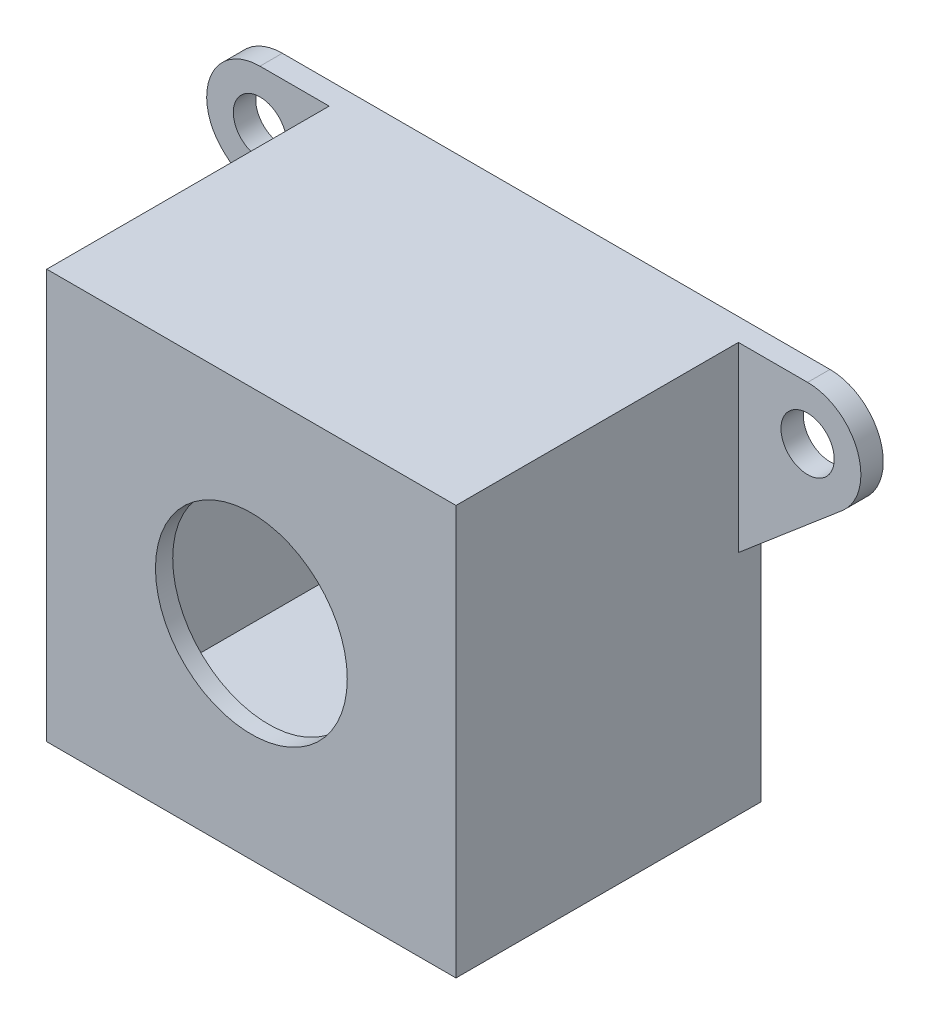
ISO-10303-21;
HEADER;
FILE_DESCRIPTION(('STEP AP214'),'2;1');
FILE_NAME('part.step','',(''),(''),'','','');
FILE_SCHEMA(('AUTOMOTIVE_DESIGN { 1 0 10303 214 1 1 1 1 }'));
ENDSEC;
DATA;
#1=APPLICATION_CONTEXT('core data for automotive mechanical design processes');
#2=APPLICATION_PROTOCOL_DEFINITION('international standard','automotive_design',2000,#1);
#3=PRODUCT_CONTEXT('',#1,'mechanical');
#4=PRODUCT('Part','Part','',(#3));
#5=PRODUCT_RELATED_PRODUCT_CATEGORY('part','',(#4));
#6=PRODUCT_DEFINITION_FORMATION('','',#4);
#7=PRODUCT_DEFINITION_CONTEXT('part definition',#1,'design');
#8=PRODUCT_DEFINITION('design','',#6,#7);
#9=PRODUCT_DEFINITION_SHAPE('','',#8);
#10=(LENGTH_UNIT() NAMED_UNIT(*) SI_UNIT(.MILLI.,.METRE.));
#11=(NAMED_UNIT(*) PLANE_ANGLE_UNIT() SI_UNIT($,.RADIAN.));
#12=(NAMED_UNIT(*) SI_UNIT($,.STERADIAN.) SOLID_ANGLE_UNIT());
#13=UNCERTAINTY_MEASURE_WITH_UNIT(LENGTH_MEASURE(1.E-05),#10,'distance_accuracy_value','');
#14=(GEOMETRIC_REPRESENTATION_CONTEXT(3) GLOBAL_UNCERTAINTY_ASSIGNED_CONTEXT((#13)) GLOBAL_UNIT_ASSIGNED_CONTEXT((#10,
#11,#12)) REPRESENTATION_CONTEXT('',''));
#15=CARTESIAN_POINT('',(0.,0.,0.));
#16=DIRECTION('',(0.,0.,1.));
#17=DIRECTION('',(1.,0.,0.));
#18=AXIS2_PLACEMENT_3D('',#15,#16,#17);
#19=CARTESIAN_POINT('',(0.,0.,2.667));
#20=DIRECTION('',(0.,0.,1.));
#21=DIRECTION('',(1.,0.,0.));
#22=AXIS2_PLACEMENT_3D('',#19,#20,#21);
#23=PLANE('',#22);
#24=DIRECTION('',(0.,1.,0.));
#25=VECTOR('',#24,1.);
#26=CARTESIAN_POINT('',(25.1785734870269,-30.3738616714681,2.667));
#27=LINE('',#26,#25);
#28=CARTESIAN_POINT('',(25.1785734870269,-3.29262330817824,2.667));
#29=VERTEX_POINT('',#28);
#30=CARTESIAN_POINT('',(25.1785734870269,18.3941383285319,2.667));
#31=VERTEX_POINT('',#30);
#32=EDGE_CURVE('E11',#29,#31,#27,.T.);
#33=ORIENTED_EDGE('',*,*,#32,.F.);
#34=DIRECTION('',(0.762118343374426,0.647437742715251,0.));
#35=VECTOR('',#34,1.);
#36=CARTESIAN_POINT('',(12.1789043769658,-14.3361528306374,2.667));
#37=LINE('',#36,#35);
#38=CARTESIAN_POINT('',(37.5352714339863,7.20468684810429,2.667));
#39=VERTEX_POINT('',#38);
#40=EDGE_CURVE('E199',#29,#39,#37,.T.);
#41=ORIENTED_EDGE('',*,*,#40,.T.);
#42=CARTESIAN_POINT('',(33.4240417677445,12.0441383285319,2.667));
#43=DIRECTION('',(0.,0.,1.));
#44=DIRECTION('',(1.,0.,0.));
#45=AXIS2_PLACEMENT_3D('',#42,#43,#44);
#46=CIRCLE('',#45,6.35);
#47=CARTESIAN_POINT('',(33.4240417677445,18.3941383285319,2.667));
#48=VERTEX_POINT('',#47);
#49=EDGE_CURVE('E218',#39,#48,#46,.T.);
#50=ORIENTED_EDGE('',*,*,#49,.T.);
#51=DIRECTION('',(1.,0.,0.));
#52=VECTOR('',#51,1.);
#53=CARTESIAN_POINT('',(0.,18.3941383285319,2.667));
#54=LINE('',#53,#52);
#55=EDGE_CURVE('E50',#31,#48,#54,.T.);
#56=ORIENTED_EDGE('',*,*,#55,.F.);
#57=EDGE_LOOP('',(#33,#41,#50,#56));
#58=FACE_BOUND('',#57,.T.);
#59=CARTESIAN_POINT('',(33.4240417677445,12.0441383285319,2.667));
#60=DIRECTION('',(0.,0.,1.));
#61=DIRECTION('',(1.,0.,0.));
#62=AXIS2_PLACEMENT_3D('',#59,#60,#61);
#63=CIRCLE('',#62,3.1749999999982);
#64=CARTESIAN_POINT('',(36.5990417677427,12.0441383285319,2.667));
#65=VERTEX_POINT('',#64);
#66=EDGE_CURVE('E228',#65,#65,#63,.F.);
#67=ORIENTED_EDGE('',*,*,#66,.T.);
#68=EDGE_LOOP('',(#67));
#69=FACE_BOUND('',#68,.T.);
#70=ADVANCED_FACE('F33',(#58,#69),#23,.T.);
#71=CARTESIAN_POINT('',(-31.8348947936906,12.0441383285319,2.667));
#72=DIRECTION('',(0.,0.,-1.));
#73=DIRECTION('',(-1.,0.,0.));
#74=AXIS2_PLACEMENT_3D('',#71,#72,#73);
#75=CYLINDRICAL_SURFACE('',#74,6.35);
#76=CARTESIAN_POINT('',(-31.8348947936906,12.0441383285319,0.));
#77=DIRECTION('',(0.,0.,1.));
#78=DIRECTION('',(1.,0.,0.));
#79=AXIS2_PLACEMENT_3D('',#76,#77,#78);
#80=CIRCLE('',#79,6.35);
#81=CARTESIAN_POINT('',(-35.9461244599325,7.20468684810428,0.));
#82=VERTEX_POINT('',#81);
#83=CARTESIAN_POINT('',(-31.8348947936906,18.3941383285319,0.));
#84=VERTEX_POINT('',#83);
#85=EDGE_CURVE('E271',#82,#84,#80,.F.);
#86=ORIENTED_EDGE('',*,*,#85,.F.);
#87=DIRECTION('',(0.,0.,-1.));
#88=VECTOR('',#87,1.);
#89=CARTESIAN_POINT('',(-35.9461244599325,7.20468684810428,2.667));
#90=LINE('',#89,#88);
#91=CARTESIAN_POINT('',(-35.9461244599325,7.20468684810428,2.667));
#92=VERTEX_POINT('',#91);
#93=EDGE_CURVE('E42',#92,#82,#90,.T.);
#94=ORIENTED_EDGE('',*,*,#93,.F.);
#95=CARTESIAN_POINT('',(-31.8348947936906,12.0441383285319,2.667));
#96=DIRECTION('',(0.,0.,1.));
#97=DIRECTION('',(1.,0.,0.));
#98=AXIS2_PLACEMENT_3D('',#95,#96,#97);
#99=CIRCLE('',#98,6.35);
#100=CARTESIAN_POINT('',(-31.8348947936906,18.3941383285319,2.667));
#101=VERTEX_POINT('',#100);
#102=EDGE_CURVE('E200',#92,#101,#99,.F.);
#103=ORIENTED_EDGE('',*,*,#102,.T.);
#104=DIRECTION('',(0.,0.,-1.));
#105=VECTOR('',#104,1.);
#106=CARTESIAN_POINT('',(-31.8348947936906,18.3941383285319,2.667));
#107=LINE('',#106,#105);
#108=EDGE_CURVE('E234',#101,#84,#107,.T.);
#109=ORIENTED_EDGE('',*,*,#108,.T.);
#110=EDGE_LOOP('',(#86,#94,#103,#109));
#111=FACE_BOUND('',#110,.T.);
#112=ADVANCED_FACE('F319',(#111),#75,.T.);
#113=CARTESIAN_POINT('',(-11.5127726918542,-13.5520292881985,2.667));
#114=DIRECTION('',(-0.647437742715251,-0.762118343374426,0.));
#115=DIRECTION('',(0.762118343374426,-0.647437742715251,0.));
#116=AXIS2_PLACEMENT_3D('',#113,#114,#115);
#117=PLANE('',#116);
#118=DIRECTION('',(-0.762118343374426,0.647437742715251,0.));
#119=VECTOR('',#118,1.);
#120=CARTESIAN_POINT('',(-11.5127726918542,-13.5520292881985,0.));
#121=LINE('',#120,#119);
#122=CARTESIAN_POINT('',(-23.5894265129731,-3.29262330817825,0.));
#123=VERTEX_POINT('',#122);
#124=EDGE_CURVE('E268',#123,#82,#121,.T.);
#125=ORIENTED_EDGE('',*,*,#124,.F.);
#126=DIRECTION('',(0.,0.,-1.));
#127=VECTOR('',#126,1.);
#128=CARTESIAN_POINT('',(-23.5894265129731,-3.29262330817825,2.667));
#129=LINE('',#128,#127);
#130=CARTESIAN_POINT('',(-23.5894265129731,-3.29262330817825,2.667));
#131=VERTEX_POINT('',#130);
#132=EDGE_CURVE('E148',#131,#123,#129,.T.);
#133=ORIENTED_EDGE('',*,*,#132,.F.);
#134=DIRECTION('',(-0.762118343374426,0.647437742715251,0.));
#135=VECTOR('',#134,1.);
#136=CARTESIAN_POINT('',(-11.5127726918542,-13.5520292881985,2.667));
#137=LINE('',#136,#135);
#138=EDGE_CURVE('E196',#131,#92,#137,.T.);
#139=ORIENTED_EDGE('',*,*,#138,.T.);
#140=ORIENTED_EDGE('',*,*,#93,.T.);
#141=EDGE_LOOP('',(#125,#133,#139,#140));
#142=FACE_BOUND('',#141,.T.);
#143=ADVANCED_FACE('F325',(#142),#117,.T.);
#144=CARTESIAN_POINT('',(-23.5894265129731,0.,2.667));
#145=DIRECTION('',(1.,0.,0.));
#146=DIRECTION('',(0.,1.,0.));
#147=AXIS2_PLACEMENT_3D('',#144,#145,#146);
#148=PLANE('',#147);
#149=DIRECTION('',(0.,-1.,0.));
#150=VECTOR('',#149,1.);
#151=CARTESIAN_POINT('',(-23.5894265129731,0.,0.));
#152=LINE('',#151,#150);
#153=CARTESIAN_POINT('',(-23.5894265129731,-30.3738616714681,0.));
#154=VERTEX_POINT('',#153);
#155=EDGE_CURVE('E145',#123,#154,#152,.T.);
#156=ORIENTED_EDGE('',*,*,#155,.T.);
#157=DIRECTION('',(0.,0.,-1.));
#158=VECTOR('',#157,1.);
#159=CARTESIAN_POINT('',(-23.5894265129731,-30.3738616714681,2.667));
#160=LINE('',#159,#158);
#161=CARTESIAN_POINT('',(-23.5894265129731,-30.3738616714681,36.322));
#162=VERTEX_POINT('',#161);
#163=EDGE_CURVE('E138',#162,#154,#160,.T.);
#164=ORIENTED_EDGE('',*,*,#163,.F.);
#165=DIRECTION('',(0.,-1.,0.));
#166=VECTOR('',#165,1.);
#167=CARTESIAN_POINT('',(-23.5894265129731,18.3941383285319,36.322));
#168=LINE('',#167,#166);
#169=CARTESIAN_POINT('',(-23.5894265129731,18.3941383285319,36.322));
#170=VERTEX_POINT('',#169);
#171=EDGE_CURVE('E143',#170,#162,#168,.T.);
#172=ORIENTED_EDGE('',*,*,#171,.F.);
#173=DIRECTION('',(0.,0.,-1.));
#174=VECTOR('',#173,1.);
#175=CARTESIAN_POINT('',(-23.5894265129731,18.3941383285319,34.2646));
#176=LINE('',#175,#174);
#177=CARTESIAN_POINT('',(-23.5894265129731,18.3941383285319,2.667));
#178=VERTEX_POINT('',#177);
#179=EDGE_CURVE('E203',#170,#178,#176,.T.);
#180=ORIENTED_EDGE('',*,*,#179,.T.);
#181=DIRECTION('',(0.,-1.,0.));
#182=VECTOR('',#181,1.);
#183=CARTESIAN_POINT('',(-23.5894265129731,-30.3738616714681,2.667));
#184=LINE('',#183,#182);
#185=EDGE_CURVE('E57',#178,#131,#184,.T.);
#186=ORIENTED_EDGE('',*,*,#185,.T.);
#187=ORIENTED_EDGE('',*,*,#132,.T.);
#188=EDGE_LOOP('',(#156,#164,#172,#180,#186,#187));
#189=FACE_BOUND('',#188,.T.);
#190=ADVANCED_FACE('F140',(#189),#148,.F.);
#191=CARTESIAN_POINT('',(0.,-30.3738616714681,2.667));
#192=DIRECTION('',(0.,1.,0.));
#193=DIRECTION('',(0.,0.,1.));
#194=AXIS2_PLACEMENT_3D('',#191,#192,#193);
#195=PLANE('',#194);
#196=DIRECTION('',(1.,0.,0.));
#197=VECTOR('',#196,1.);
#198=CARTESIAN_POINT('',(0.,-30.3738616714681,0.));
#199=LINE('',#198,#197);
#200=CARTESIAN_POINT('',(25.1785734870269,-30.3738616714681,0.));
#201=VERTEX_POINT('',#200);
#202=EDGE_CURVE('E265',#154,#201,#199,.T.);
#203=ORIENTED_EDGE('',*,*,#202,.T.);
#204=DIRECTION('',(0.,0.,-1.));
#205=VECTOR('',#204,1.);
#206=CARTESIAN_POINT('',(25.1785734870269,-30.3738616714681,2.667));
#207=LINE('',#206,#205);
#208=CARTESIAN_POINT('',(25.1785734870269,-30.3738616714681,36.322));
#209=VERTEX_POINT('',#208);
#210=EDGE_CURVE('E149',#209,#201,#207,.T.);
#211=ORIENTED_EDGE('',*,*,#210,.F.);
#212=DIRECTION('',(1.,0.,0.));
#213=VECTOR('',#212,1.);
#214=CARTESIAN_POINT('',(-23.5894265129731,-30.3738616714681,36.322));
#215=LINE('',#214,#213);
#216=EDGE_CURVE('E152',#162,#209,#215,.T.);
#217=ORIENTED_EDGE('',*,*,#216,.F.);
#218=ORIENTED_EDGE('',*,*,#163,.T.);
#219=EDGE_LOOP('',(#203,#211,#217,#218));
#220=FACE_BOUND('',#219,.T.);
#221=ADVANCED_FACE('F153',(#220),#195,.F.);
#222=CARTESIAN_POINT('',(25.1785734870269,0.,2.667));
#223=DIRECTION('',(1.,0.,0.));
#224=DIRECTION('',(0.,1.,0.));
#225=AXIS2_PLACEMENT_3D('',#222,#223,#224);
#226=PLANE('',#225);
#227=DIRECTION('',(0.,-1.,0.));
#228=VECTOR('',#227,1.);
#229=CARTESIAN_POINT('',(25.1785734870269,0.,0.));
#230=LINE('',#229,#228);
#231=CARTESIAN_POINT('',(25.1785734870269,-3.29262330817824,0.));
#232=VERTEX_POINT('',#231);
#233=EDGE_CURVE('E262',#232,#201,#230,.T.);
#234=ORIENTED_EDGE('',*,*,#233,.F.);
#235=DIRECTION('',(0.,0.,-1.));
#236=VECTOR('',#235,1.);
#237=CARTESIAN_POINT('',(25.1785734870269,-3.29262330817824,2.667));
#238=LINE('',#237,#236);
#239=EDGE_CURVE('E213',#29,#232,#238,.T.);
#240=ORIENTED_EDGE('',*,*,#239,.F.);
#241=ORIENTED_EDGE('',*,*,#32,.T.);
#242=DIRECTION('',(0.,0.,-1.));
#243=VECTOR('',#242,1.);
#244=CARTESIAN_POINT('',(25.1785734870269,18.3941383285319,34.2646));
#245=LINE('',#244,#243);
#246=CARTESIAN_POINT('',(25.1785734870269,18.3941383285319,36.322));
#247=VERTEX_POINT('',#246);
#248=EDGE_CURVE('E205',#247,#31,#245,.T.);
#249=ORIENTED_EDGE('',*,*,#248,.F.);
#250=DIRECTION('',(0.,1.,0.));
#251=VECTOR('',#250,1.);
#252=CARTESIAN_POINT('',(25.1785734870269,18.3941383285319,36.322));
#253=LINE('',#252,#251);
#254=EDGE_CURVE('E157',#209,#247,#253,.T.);
#255=ORIENTED_EDGE('',*,*,#254,.F.);
#256=ORIENTED_EDGE('',*,*,#210,.T.);
#257=EDGE_LOOP('',(#234,#240,#241,#249,#255,#256));
#258=FACE_BOUND('',#257,.T.);
#259=ADVANCED_FACE('F356',(#258),#226,.T.);
#260=CARTESIAN_POINT('',(12.1789043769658,-14.3361528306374,2.667));
#261=DIRECTION('',(-0.647437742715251,0.762118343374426,0.));
#262=DIRECTION('',(-0.762118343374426,-0.647437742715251,0.));
#263=AXIS2_PLACEMENT_3D('',#260,#261,#262);
#264=PLANE('',#263);
#265=DIRECTION('',(0.762118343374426,0.647437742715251,0.));
#266=VECTOR('',#265,1.);
#267=CARTESIAN_POINT('',(12.1789043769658,-14.3361528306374,0.));
#268=LINE('',#267,#266);
#269=CARTESIAN_POINT('',(37.5352714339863,7.20468684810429,0.));
#270=VERTEX_POINT('',#269);
#271=EDGE_CURVE('E259',#232,#270,#268,.T.);
#272=ORIENTED_EDGE('',*,*,#271,.T.);
#273=DIRECTION('',(0.,0.,-1.));
#274=VECTOR('',#273,1.);
#275=CARTESIAN_POINT('',(37.5352714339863,7.20468684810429,2.667));
#276=LINE('',#275,#274);
#277=EDGE_CURVE('E215',#39,#270,#276,.T.);
#278=ORIENTED_EDGE('',*,*,#277,.F.);
#279=ORIENTED_EDGE('',*,*,#40,.F.);
#280=ORIENTED_EDGE('',*,*,#239,.T.);
#281=EDGE_LOOP('',(#272,#278,#279,#280));
#282=FACE_BOUND('',#281,.T.);
#283=ADVANCED_FACE('F360',(#282),#264,.F.);
#284=CARTESIAN_POINT('',(33.4240417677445,12.0441383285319,2.667));
#285=DIRECTION('',(0.,0.,-1.));
#286=DIRECTION('',(-1.,0.,0.));
#287=AXIS2_PLACEMENT_3D('',#284,#285,#286);
#288=CYLINDRICAL_SURFACE('',#287,6.35);
#289=CARTESIAN_POINT('',(33.4240417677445,12.0441383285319,0.));
#290=DIRECTION('',(0.,0.,1.));
#291=DIRECTION('',(1.,0.,0.));
#292=AXIS2_PLACEMENT_3D('',#289,#290,#291);
#293=CIRCLE('',#292,6.35);
#294=CARTESIAN_POINT('',(33.4240417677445,18.3941383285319,0.));
#295=VERTEX_POINT('',#294);
#296=EDGE_CURVE('E256',#270,#295,#293,.T.);
#297=ORIENTED_EDGE('',*,*,#296,.T.);
#298=DIRECTION('',(0.,0.,-1.));
#299=VECTOR('',#298,1.);
#300=CARTESIAN_POINT('',(33.4240417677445,18.3941383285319,2.667));
#301=LINE('',#300,#299);
#302=EDGE_CURVE('E246',#48,#295,#301,.T.);
#303=ORIENTED_EDGE('',*,*,#302,.F.);
#304=ORIENTED_EDGE('',*,*,#49,.F.);
#305=ORIENTED_EDGE('',*,*,#277,.T.);
#306=EDGE_LOOP('',(#297,#303,#304,#305));
#307=FACE_BOUND('',#306,.T.);
#308=ADVANCED_FACE('F358',(#307),#288,.T.);
#309=CARTESIAN_POINT('',(0.,15.2191383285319,2.667));
#310=DIRECTION('',(0.,-1.,0.));
#311=DIRECTION('',(0.,0.,-1.));
#312=AXIS2_PLACEMENT_3D('',#309,#310,#311);
#313=PLANE('',#312);
#314=DIRECTION('',(-1.,0.,0.));
#315=VECTOR('',#314,1.);
#316=CARTESIAN_POINT('',(0.,15.2191383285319,0.));
#317=LINE('',#316,#315);
#318=CARTESIAN_POINT('',(22.0035734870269,15.2191383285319,0.));
#319=VERTEX_POINT('',#318);
#320=CARTESIAN_POINT('',(-20.4144265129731,15.2191383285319,0.));
#321=VERTEX_POINT('',#320);
#322=EDGE_CURVE('E210',#319,#321,#317,.T.);
#323=ORIENTED_EDGE('',*,*,#322,.F.);
#324=DIRECTION('',(0.,0.,-1.));
#325=VECTOR('',#324,1.);
#326=CARTESIAN_POINT('',(22.0035734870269,15.2191383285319,2.667));
#327=LINE('',#326,#325);
#328=CARTESIAN_POINT('',(22.0035734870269,15.2191383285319,34.2646));
#329=VERTEX_POINT('',#328);
#330=EDGE_CURVE('E232',#329,#319,#327,.T.);
#331=ORIENTED_EDGE('',*,*,#330,.F.);
#332=DIRECTION('',(-1.,0.,0.));
#333=VECTOR('',#332,1.);
#334=CARTESIAN_POINT('',(-20.4144265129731,15.2191383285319,34.2646));
#335=LINE('',#334,#333);
#336=CARTESIAN_POINT('',(-20.4144265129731,15.2191383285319,34.2646));
#337=VERTEX_POINT('',#336);
#338=EDGE_CURVE('E182',#329,#337,#335,.T.);
#339=ORIENTED_EDGE('',*,*,#338,.T.);
#340=DIRECTION('',(0.,0.,-1.));
#341=VECTOR('',#340,1.);
#342=CARTESIAN_POINT('',(-20.4144265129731,15.2191383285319,2.667));
#343=LINE('',#342,#341);
#344=EDGE_CURVE('E240',#337,#321,#343,.T.);
#345=ORIENTED_EDGE('',*,*,#344,.T.);
#346=EDGE_LOOP('',(#323,#331,#339,#345));
#347=FACE_BOUND('',#346,.T.);
#348=ADVANCED_FACE('F35',(#347),#313,.T.);
#349=CARTESIAN_POINT('',(22.0035734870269,0.,2.667));
#350=DIRECTION('',(1.,0.,0.));
#351=DIRECTION('',(0.,1.,0.));
#352=AXIS2_PLACEMENT_3D('',#349,#350,#351);
#353=PLANE('',#352);
#354=DIRECTION('',(0.,-1.,0.));
#355=VECTOR('',#354,1.);
#356=CARTESIAN_POINT('',(22.0035734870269,0.,0.));
#357=LINE('',#356,#355);
#358=CARTESIAN_POINT('',(22.0035734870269,-27.1988616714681,0.));
#359=VERTEX_POINT('',#358);
#360=EDGE_CURVE('E283',#319,#359,#357,.T.);
#361=ORIENTED_EDGE('',*,*,#360,.T.);
#362=DIRECTION('',(0.,0.,-1.));
#363=VECTOR('',#362,1.);
#364=CARTESIAN_POINT('',(22.0035734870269,-27.1988616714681,2.667));
#365=LINE('',#364,#363);
#366=CARTESIAN_POINT('',(22.0035734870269,-27.1988616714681,34.2646));
#367=VERTEX_POINT('',#366);
#368=EDGE_CURVE('E235',#367,#359,#365,.T.);
#369=ORIENTED_EDGE('',*,*,#368,.F.);
#370=DIRECTION('',(0.,1.,0.));
#371=VECTOR('',#370,1.);
#372=CARTESIAN_POINT('',(22.0035734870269,-27.1988616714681,34.2646));
#373=LINE('',#372,#371);
#374=EDGE_CURVE('E179',#367,#329,#373,.T.);
#375=ORIENTED_EDGE('',*,*,#374,.T.);
#376=ORIENTED_EDGE('',*,*,#330,.T.);
#377=EDGE_LOOP('',(#361,#369,#375,#376));
#378=FACE_BOUND('',#377,.T.);
#379=ADVANCED_FACE('F302',(#378),#353,.F.);
#380=CARTESIAN_POINT('',(0.,-27.1988616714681,2.667));
#381=DIRECTION('',(0.,-1.,0.));
#382=DIRECTION('',(0.,0.,-1.));
#383=AXIS2_PLACEMENT_3D('',#380,#381,#382);
#384=PLANE('',#383);
#385=DIRECTION('',(-1.,0.,0.));
#386=VECTOR('',#385,1.);
#387=CARTESIAN_POINT('',(0.,-27.1988616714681,0.));
#388=LINE('',#387,#386);
#389=CARTESIAN_POINT('',(-20.4144265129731,-27.1988616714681,0.));
#390=VERTEX_POINT('',#389);
#391=EDGE_CURVE('E280',#359,#390,#388,.T.);
#392=ORIENTED_EDGE('',*,*,#391,.T.);
#393=DIRECTION('',(0.,0.,-1.));
#394=VECTOR('',#393,1.);
#395=CARTESIAN_POINT('',(-20.4144265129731,-27.1988616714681,2.667));
#396=LINE('',#395,#394);
#397=CARTESIAN_POINT('',(-20.4144265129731,-27.1988616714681,34.2646));
#398=VERTEX_POINT('',#397);
#399=EDGE_CURVE('E238',#398,#390,#396,.T.);
#400=ORIENTED_EDGE('',*,*,#399,.F.);
#401=DIRECTION('',(1.,0.,0.));
#402=VECTOR('',#401,1.);
#403=CARTESIAN_POINT('',(-20.4144265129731,-27.1988616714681,34.2646));
#404=LINE('',#403,#402);
#405=EDGE_CURVE('E176',#398,#367,#404,.T.);
#406=ORIENTED_EDGE('',*,*,#405,.T.);
#407=ORIENTED_EDGE('',*,*,#368,.T.);
#408=EDGE_LOOP('',(#392,#400,#406,#407));
#409=FACE_BOUND('',#408,.T.);
#410=ADVANCED_FACE('F299',(#409),#384,.F.);
#411=CARTESIAN_POINT('',(0.,18.3941383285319,2.667));
#412=DIRECTION('',(0.,1.,0.));
#413=DIRECTION('',(0.,0.,1.));
#414=AXIS2_PLACEMENT_3D('',#411,#412,#413);
#415=PLANE('',#414);
#416=DIRECTION('',(1.,0.,0.));
#417=VECTOR('',#416,1.);
#418=CARTESIAN_POINT('',(0.,18.3941383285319,0.));
#419=LINE('',#418,#417);
#420=EDGE_CURVE('E253',#84,#295,#419,.T.);
#421=ORIENTED_EDGE('',*,*,#420,.F.);
#422=ORIENTED_EDGE('',*,*,#108,.F.);
#423=EDGE_CURVE('E223',#101,#178,#54,.T.);
#424=ORIENTED_EDGE('',*,*,#423,.T.);
#425=ORIENTED_EDGE('',*,*,#179,.F.);
#426=DIRECTION('',(-1.,0.,0.));
#427=VECTOR('',#426,1.);
#428=CARTESIAN_POINT('',(-23.5894265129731,18.3941383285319,36.322));
#429=LINE('',#428,#427);
#430=EDGE_CURVE('E163',#247,#170,#429,.T.);
#431=ORIENTED_EDGE('',*,*,#430,.F.);
#432=ORIENTED_EDGE('',*,*,#248,.T.);
#433=ORIENTED_EDGE('',*,*,#55,.T.);
#434=ORIENTED_EDGE('',*,*,#302,.T.);
#435=EDGE_LOOP('',(#421,#422,#424,#425,#431,#432,#433,#434));
#436=FACE_BOUND('',#435,.T.);
#437=ADVANCED_FACE('F345',(#436),#415,.T.);
#438=CARTESIAN_POINT('',(-31.8348947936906,12.0441383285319,2.667));
#439=DIRECTION('',(0.,0.,-1.));
#440=DIRECTION('',(-1.,0.,0.));
#441=AXIS2_PLACEMENT_3D('',#438,#439,#440);
#442=CYLINDRICAL_SURFACE('',#441,3.1749999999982);
#443=CARTESIAN_POINT('',(-31.8348947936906,12.0441383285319,2.667));
#444=DIRECTION('',(0.,0.,1.));
#445=DIRECTION('',(1.,0.,0.));
#446=AXIS2_PLACEMENT_3D('',#443,#444,#445);
#447=CIRCLE('',#446,3.1749999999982);
#448=CARTESIAN_POINT('',(-28.6598947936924,12.0441383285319,2.667));
#449=VERTEX_POINT('',#448);
#450=EDGE_CURVE('E252',#449,#449,#447,.T.);
#451=ORIENTED_EDGE('',*,*,#450,.T.);
#452=EDGE_LOOP('',(#451));
#453=FACE_BOUND('',#452,.T.);
#454=CARTESIAN_POINT('',(-31.8348947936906,12.0441383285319,0.));
#455=DIRECTION('',(0.,0.,1.));
#456=DIRECTION('',(1.,0.,0.));
#457=AXIS2_PLACEMENT_3D('',#454,#455,#456);
#458=CIRCLE('',#457,3.1749999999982);
#459=CARTESIAN_POINT('',(-28.6598947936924,12.0441383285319,0.));
#460=VERTEX_POINT('',#459);
#461=EDGE_CURVE('E274',#460,#460,#458,.T.);
#462=ORIENTED_EDGE('',*,*,#461,.F.);
#463=EDGE_LOOP('',(#462));
#464=FACE_BOUND('',#463,.T.);
#465=ADVANCED_FACE('F377',(#453,#464),#442,.F.);
#466=CARTESIAN_POINT('',(-20.4144265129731,0.,2.667));
#467=DIRECTION('',(1.,0.,0.));
#468=DIRECTION('',(0.,1.,0.));
#469=AXIS2_PLACEMENT_3D('',#466,#467,#468);
#470=PLANE('',#469);
#471=DIRECTION('',(0.,-1.,0.));
#472=VECTOR('',#471,1.);
#473=CARTESIAN_POINT('',(-20.4144265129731,0.,0.));
#474=LINE('',#473,#472);
#475=EDGE_CURVE('E277',#321,#390,#474,.T.);
#476=ORIENTED_EDGE('',*,*,#475,.F.);
#477=ORIENTED_EDGE('',*,*,#344,.F.);
#478=DIRECTION('',(0.,-1.,0.));
#479=VECTOR('',#478,1.);
#480=CARTESIAN_POINT('',(-20.4144265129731,-27.1988616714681,34.2646));
#481=LINE('',#480,#479);
#482=EDGE_CURVE('E173',#337,#398,#481,.T.);
#483=ORIENTED_EDGE('',*,*,#482,.T.);
#484=ORIENTED_EDGE('',*,*,#399,.T.);
#485=EDGE_LOOP('',(#476,#477,#483,#484));
#486=FACE_BOUND('',#485,.T.);
#487=ADVANCED_FACE('F296',(#486),#470,.T.);
#488=CARTESIAN_POINT('',(33.4240417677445,12.0441383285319,2.667));
#489=DIRECTION('',(0.,0.,-1.));
#490=DIRECTION('',(-1.,0.,0.));
#491=AXIS2_PLACEMENT_3D('',#488,#489,#490);
#492=CYLINDRICAL_SURFACE('',#491,3.1749999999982);
#493=ORIENTED_EDGE('',*,*,#66,.F.);
#494=EDGE_LOOP('',(#493));
#495=FACE_BOUND('',#494,.T.);
#496=CARTESIAN_POINT('',(33.4240417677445,12.0441383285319,0.));
#497=DIRECTION('',(0.,0.,1.));
#498=DIRECTION('',(1.,0.,0.));
#499=AXIS2_PLACEMENT_3D('',#496,#497,#498);
#500=CIRCLE('',#499,3.1749999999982);
#501=CARTESIAN_POINT('',(36.5990417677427,12.0441383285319,0.));
#502=VERTEX_POINT('',#501);
#503=EDGE_CURVE('E249',#502,#502,#500,.F.);
#504=ORIENTED_EDGE('',*,*,#503,.T.);
#505=EDGE_LOOP('',(#504));
#506=FACE_BOUND('',#505,.T.);
#507=ADVANCED_FACE('F331',(#495,#506),#492,.F.);
#508=ORIENTED_EDGE('',*,*,#185,.F.);
#509=ORIENTED_EDGE('',*,*,#423,.F.);
#510=ORIENTED_EDGE('',*,*,#102,.F.);
#511=ORIENTED_EDGE('',*,*,#138,.F.);
#512=EDGE_LOOP('',(#508,#509,#510,#511));
#513=FACE_BOUND('',#512,.T.);
#514=ORIENTED_EDGE('',*,*,#450,.F.);
#515=EDGE_LOOP('',(#514));
#516=FACE_BOUND('',#515,.T.);
#517=ADVANCED_FACE('F321',(#513,#516),#23,.T.);
#518=CARTESIAN_POINT('',(0.,0.,0.));
#519=DIRECTION('',(0.,0.,1.));
#520=DIRECTION('',(1.,0.,0.));
#521=AXIS2_PLACEMENT_3D('',#518,#519,#520);
#522=PLANE('',#521);
#523=ORIENTED_EDGE('',*,*,#322,.T.);
#524=ORIENTED_EDGE('',*,*,#475,.T.);
#525=ORIENTED_EDGE('',*,*,#391,.F.);
#526=ORIENTED_EDGE('',*,*,#360,.F.);
#527=EDGE_LOOP('',(#523,#524,#525,#526));
#528=FACE_BOUND('',#527,.T.);
#529=ORIENTED_EDGE('',*,*,#461,.T.);
#530=EDGE_LOOP('',(#529));
#531=FACE_BOUND('',#530,.T.);
#532=ORIENTED_EDGE('',*,*,#85,.T.);
#533=ORIENTED_EDGE('',*,*,#420,.T.);
#534=ORIENTED_EDGE('',*,*,#296,.F.);
#535=ORIENTED_EDGE('',*,*,#271,.F.);
#536=ORIENTED_EDGE('',*,*,#233,.T.);
#537=ORIENTED_EDGE('',*,*,#202,.F.);
#538=ORIENTED_EDGE('',*,*,#155,.F.);
#539=ORIENTED_EDGE('',*,*,#124,.T.);
#540=EDGE_LOOP('',(#532,#533,#534,#535,#536,#537,#538,#539));
#541=FACE_BOUND('',#540,.T.);
#542=ORIENTED_EDGE('',*,*,#503,.F.);
#543=EDGE_LOOP('',(#542));
#544=FACE_BOUND('',#543,.T.);
#545=ADVANCED_FACE('F289',(#528,#531,#541,#544),#522,.F.);
#546=CARTESIAN_POINT('',(0.,0.,36.322));
#547=DIRECTION('',(0.,0.,1.));
#548=DIRECTION('',(1.,0.,0.));
#549=AXIS2_PLACEMENT_3D('',#546,#547,#548);
#550=PLANE('',#549);
#551=ORIENTED_EDGE('',*,*,#171,.T.);
#552=ORIENTED_EDGE('',*,*,#216,.T.);
#553=ORIENTED_EDGE('',*,*,#254,.T.);
#554=ORIENTED_EDGE('',*,*,#430,.T.);
#555=EDGE_LOOP('',(#551,#552,#553,#554));
#556=FACE_BOUND('',#555,.T.);
#557=CARTESIAN_POINT('',(0.794573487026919,-5.9898616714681,36.322));
#558=DIRECTION('',(0.,0.,1.));
#559=DIRECTION('',(1.,0.,0.));
#560=AXIS2_PLACEMENT_3D('',#557,#558,#559);
#561=CIRCLE('',#560,11.43);
#562=CARTESIAN_POINT('',(12.2245734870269,-5.9898616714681,36.322));
#563=VERTEX_POINT('',#562);
#564=EDGE_CURVE('E164',#563,#563,#561,.T.);
#565=ORIENTED_EDGE('',*,*,#564,.F.);
#566=EDGE_LOOP('',(#565));
#567=FACE_BOUND('',#566,.T.);
#568=ADVANCED_FACE('F160',(#556,#567),#550,.T.);
#569=CARTESIAN_POINT('',(0.,0.,34.2646));
#570=DIRECTION('',(0.,0.,1.));
#571=DIRECTION('',(1.,0.,0.));
#572=AXIS2_PLACEMENT_3D('',#569,#570,#571);
#573=PLANE('',#572);
#574=ORIENTED_EDGE('',*,*,#338,.F.);
#575=ORIENTED_EDGE('',*,*,#374,.F.);
#576=ORIENTED_EDGE('',*,*,#405,.F.);
#577=ORIENTED_EDGE('',*,*,#482,.F.);
#578=EDGE_LOOP('',(#574,#575,#576,#577));
#579=FACE_BOUND('',#578,.T.);
#580=CARTESIAN_POINT('',(0.794573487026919,-5.9898616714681,34.2646));
#581=DIRECTION('',(0.,0.,1.));
#582=DIRECTION('',(1.,0.,0.));
#583=AXIS2_PLACEMENT_3D('',#580,#581,#582);
#584=CIRCLE('',#583,11.43);
#585=CARTESIAN_POINT('',(12.2245734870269,-5.9898616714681,34.2646));
#586=VERTEX_POINT('',#585);
#587=EDGE_CURVE('E167',#586,#586,#584,.T.);
#588=ORIENTED_EDGE('',*,*,#587,.T.);
#589=EDGE_LOOP('',(#588));
#590=FACE_BOUND('',#589,.T.);
#591=ADVANCED_FACE('F304',(#579,#590),#573,.F.);
#592=CARTESIAN_POINT('',(0.794573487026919,-5.9898616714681,36.322));
#593=DIRECTION('',(0.,0.,-1.));
#594=DIRECTION('',(-1.,0.,0.));
#595=AXIS2_PLACEMENT_3D('',#592,#593,#594);
#596=CYLINDRICAL_SURFACE('',#595,11.43);
#597=ORIENTED_EDGE('',*,*,#564,.T.);
#598=EDGE_LOOP('',(#597));
#599=FACE_BOUND('',#598,.T.);
#600=ORIENTED_EDGE('',*,*,#587,.F.);
#601=EDGE_LOOP('',(#600));
#602=FACE_BOUND('',#601,.T.);
#603=ADVANCED_FACE('F307',(#599,#602),#596,.F.);
#604=CLOSED_SHELL('',(#70,#112,#143,#190,#221,#259,#283,#308,#348,#379,#410,#437,#465,#487,#507,
#517,#545,#568,#591,#603));
#605=MANIFOLD_SOLID_BREP('B2',#604);
#606=ADVANCED_BREP_SHAPE_REPRESENTATION('',(#18,#605),#14);
#607=SHAPE_DEFINITION_REPRESENTATION(#9,#606);
ENDSEC;
END-ISO-10303-21;
